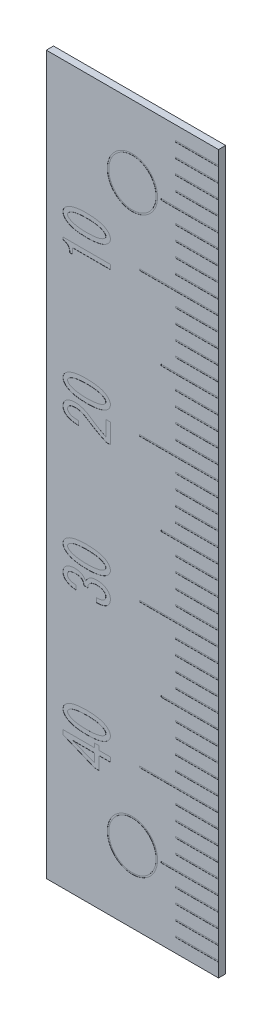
from build123d import *

# Parameters (mm, degrees)
SKETCH1_W      = 12
SKETCH1_H      = 50
EXTRUDE1_DEPTH = 0.5
SKETCH2_R      = 1.75
SKETCH2_R_2    = 1.65
EXTRUDE2_DEPTH = 0.01
EXTRUDE3_DEPTH = 0.01
SKETCH4_W      = 5.5
SKETCH4_H      = 0.1
SKETCH4_W_2    = 3
SKETCH4_W_3    = 4
EXTRUDE4_DEPTH = 0.01


with BuildPart() as part:
    # Sketch1 → Extrude1 (new body)
    with BuildSketch(Plane.XY):
        with Locations((6, 25)):
            Rectangle(SKETCH1_W, SKETCH1_H)
    extrude(amount=EXTRUDE1_DEPTH)

    # Sketch2 → Extrude2 (cut)
    # profile 1 of 2: a face of its own
    with BuildSketch(Plane.XY.offset(0.5)):
        with Locations((6, 5)):
            Circle(SKETCH2_R)
        with Locations((6, 5)):
            Circle(SKETCH2_R_2, mode=Mode.SUBTRACT)
    # profile 2 of 2: a face of its own
    with BuildSketch(Plane.XY.offset(0.5)):
        with Locations((6, 45)):
            Circle(SKETCH2_R)
        with Locations((6, 45)):
            Circle(SKETCH2_R_2, mode=Mode.SUBTRACT)
    extrude(amount=-EXTRUDE2_DEPTH, mode=Mode.SUBTRACT)

    # Sketch3 → Extrude3 (cut)
    # profile 1 of 8: a face of its own
    with BuildSketch(Plane.XY.offset(0.5)):
        with BuildLine():
            Line((4.464202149, 38.983541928), (3.143449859, 38.983541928))
            Line((3.143449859, 38.983541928), (1.834630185, 38.983541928))
            Line((1.834630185, 38.983541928), (1.834630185, 38.58788147))
            Line((1.834630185, 38.58788147), (1.634287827, 38.58788147))
            add(Edge.make_bspline(
                [(1.634287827, 38.58788147), (1.633949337, 38.607154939), (1.633292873, 38.644533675), (1.627537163, 38.699138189), (1.617992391, 38.750485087), (1.605914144, 38.79930573), (1.588535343, 38.844454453), (1.568559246, 38.887235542), (1.544100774, 38.926478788), (1.516032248, 38.962796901), (1.484633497, 38.996211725), (1.449221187, 39.026469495), (1.410057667, 39.053561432), (1.367120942, 39.077453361), (1.320438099, 39.09818504), (1.270182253, 39.115604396), (1.216225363, 39.130205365), (1.17880858, 39.137442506), (1.159495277, 39.141178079)],
                knots=[0, 0, 0, 0, 1.144858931, 2.220325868, 3.257124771, 4.246590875, 5.202985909, 6.126465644, 7.048017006, 7.94360395, 8.849836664, 9.767181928, 10.705616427, 11.674465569, 12.68221077, 13.736395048, 14.831602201, 16, 16, 16, 16], degree=3))
            Line((1.159495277, 39.141178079), (1.159495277, 39.303210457))
            Line((1.159495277, 39.303210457), (4.464202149, 39.303210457))
            Line((4.464202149, 39.303210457), (4.464202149, 38.983541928))
        make_face()
    # profile 2 of 8: a face of its own
    with BuildSketch(Plane.XY.offset(0.5)):
        with BuildLine():
            add(Edge.make_bspline(
                [(2.804312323, 40.08636695), (2.763487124, 40.086598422), (2.683284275, 40.087053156), (2.565184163, 40.090916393), (2.451677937, 40.097059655), (2.342790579, 40.105920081), (2.238418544, 40.116877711), (2.138826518, 40.131643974), (2.043659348, 40.147711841), (1.953367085, 40.166540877), (1.867534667, 40.187646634), (1.786660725, 40.212475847), (1.709981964, 40.238496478), (1.63792646, 40.267351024), (1.571052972, 40.299483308), (1.508231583, 40.333293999), (1.450513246, 40.370357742), (1.414537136, 40.397244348), (1.396891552, 40.410431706)],
                knots=[0, 0, 0, 0, 1.334199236, 2.621091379, 3.861325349, 5.048806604, 6.191184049, 7.29033474, 8.338632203, 9.344988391, 10.304094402, 11.226124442, 12.10888774, 12.949942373, 13.760906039, 14.53244093, 15.280190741, 16, 16, 16, 16], degree=3))
            add(Edge.make_bspline(
                [(1.396891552, 40.410431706), (1.377886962, 40.425936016), (1.341081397, 40.455962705), (1.293642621, 40.506288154), (1.25209867, 40.556343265), (1.218531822, 40.608467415), (1.191781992, 40.661574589), (1.173561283, 40.716630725), (1.161657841, 40.77250316), (1.160214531, 40.810429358), (1.159495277, 40.829329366)],
                knots=[0, 0, 0, 0, 1.179273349, 2.283859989, 3.322502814, 4.306324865, 5.261663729, 6.17616916, 7.091118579, 8, 8, 8, 8], degree=3))
            add(Edge.make_bspline(
                [(1.159495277, 40.829329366), (1.160212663, 40.848230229), (1.161652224, 40.886158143), (1.17358392, 40.942017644), (1.191636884, 40.996945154), (1.218688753, 41.049705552), (1.252296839, 41.101723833), (1.293217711, 41.152330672), (1.341340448, 41.202029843), (1.377935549, 41.232049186), (1.396891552, 41.247598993)],
                knots=[0, 0, 0, 0, 0.909839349, 1.825753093, 2.741222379, 3.688535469, 4.673394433, 5.720979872, 6.819483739, 8, 8, 8, 8], degree=3))
            add(Edge.make_bspline(
                [(1.396891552, 41.247598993), (1.414537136, 41.260786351), (1.450513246, 41.287672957), (1.508231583, 41.3247367), (1.571052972, 41.358547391), (1.63792646, 41.390679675), (1.709981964, 41.419534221), (1.786660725, 41.445554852), (1.867534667, 41.470384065), (1.953367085, 41.491489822), (2.043659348, 41.510318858), (2.138826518, 41.526386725), (2.238418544, 41.541152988), (2.342790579, 41.552110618), (2.451677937, 41.560971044), (2.565184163, 41.567114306), (2.683284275, 41.570977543), (2.763487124, 41.571432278), (2.804312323, 41.571663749)],
                knots=[0, 0, 0, 0, 0.719809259, 1.46755907, 2.239093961, 3.050057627, 3.89111226, 4.773875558, 5.695905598, 6.655011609, 7.661367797, 8.70966526, 9.808815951, 10.951193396, 12.138674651, 13.378908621, 14.665800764, 16, 16, 16, 16], degree=3))
            add(Edge.make_bspline(
                [(2.804312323, 41.571663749), (2.845974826, 41.571432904), (2.927642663, 41.570980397), (3.047627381, 41.567132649), (3.162805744, 41.560946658), (3.273365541, 41.552091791), (3.379218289, 41.541255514), (3.480042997, 41.52631378), (3.576267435, 41.510328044), (3.667806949, 41.49146689), (3.75471717, 41.470480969), (3.836402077, 41.445542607), (3.913707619, 41.419531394), (3.986394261, 41.390685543), (4.053875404, 41.358519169), (4.117234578, 41.324907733), (4.175058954, 41.28765614), (4.211041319, 41.260780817), (4.228689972, 41.247598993)],
                knots=[0, 0, 0, 0, 1.346341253, 2.639130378, 3.8790076, 5.073442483, 6.223226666, 7.316783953, 8.366697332, 9.375051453, 10.336565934, 11.254764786, 12.134057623, 12.971986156, 13.779994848, 14.548849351, 15.288238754, 16, 16, 16, 16], degree=3))
            add(Edge.make_bspline(
                [(4.228689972, 41.247598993), (4.247351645, 41.231964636), (4.283604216, 41.201592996), (4.332476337, 41.152791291), (4.372490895, 41.101447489), (4.406527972, 41.049937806), (4.432289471, 40.996615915), (4.451811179, 40.942259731), (4.462410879, 40.886054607), (4.464024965, 40.848209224), (4.464830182, 40.829329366)],
                knots=[0, 0, 0, 0, 1.1743338, 2.28128622, 3.323893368, 4.309986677, 5.254013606, 6.173907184, 7.08902033, 8, 8, 8, 8], degree=3))
            add(Edge.make_bspline(
                [(4.464830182, 40.829329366), (4.464023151, 40.81045032), (4.462405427, 40.772606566), (4.45183315, 40.716389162), (4.432141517, 40.661902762), (4.406685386, 40.608236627), (4.372691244, 40.556620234), (4.332051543, 40.505827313), (4.283860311, 40.456400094), (4.247399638, 40.426020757), (4.228689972, 40.410431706)],
                knots=[0, 0, 0, 0, 0.910025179, 1.824179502, 2.743109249, 3.69522398, 4.680284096, 5.713901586, 6.826896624, 8, 8, 8, 8], degree=3))
            add(Edge.make_bspline(
                [(4.228689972, 40.410431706), (4.211041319, 40.397249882), (4.175058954, 40.370374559), (4.117234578, 40.333122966), (4.053875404, 40.29951153), (3.986394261, 40.267345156), (3.913707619, 40.238499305), (3.836402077, 40.212488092), (3.75471717, 40.18754973), (3.667806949, 40.166563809), (3.576267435, 40.147702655), (3.480042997, 40.131716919), (3.379218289, 40.116775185), (3.273365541, 40.105938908), (3.162805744, 40.097084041), (3.047627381, 40.09089805), (2.927642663, 40.087050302), (2.845974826, 40.086597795), (2.804312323, 40.08636695)],
                knots=[0, 0, 0, 0, 0.711761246, 1.451150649, 2.220005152, 3.028013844, 3.865942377, 4.745235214, 5.663434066, 6.624948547, 7.633302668, 8.683216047, 9.776773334, 10.926557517, 12.1209924, 13.360869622, 14.653658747, 16, 16, 16, 16], degree=3))
        make_face()
        with BuildLine():
            add(Edge.make_bspline(
                [(2.804312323, 41.261415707), (2.767676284, 41.261069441), (2.695861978, 41.260390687), (2.590316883, 41.258165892), (2.489150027, 41.253278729), (2.392481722, 41.245290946), (2.30022693, 41.237179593), (2.212814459, 41.225295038), (2.129718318, 41.213328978), (2.051258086, 41.197943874), (1.97692929, 41.181420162), (1.907398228, 41.16150603), (1.841873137, 41.141413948), (1.781453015, 41.117852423), (1.725379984, 41.092883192), (1.673815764, 41.065786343), (1.626168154, 41.037204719), (1.597468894, 41.015283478), (1.583417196, 41.004550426)],
                knots=[0, 0, 0, 0, 1.387476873, 2.71974516, 3.997715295, 5.222316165, 6.392993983, 7.5041764, 8.562605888, 9.571696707, 10.531368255, 11.445041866, 12.310057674, 13.125709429, 13.899281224, 14.633331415, 15.330853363, 16, 16, 16, 16], degree=3))
            add(Edge.make_bspline(
                [(1.583417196, 41.004550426), (1.567942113, 40.991309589), (1.538992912, 40.966539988), (1.506840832, 40.922559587), (1.485224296, 40.87705391), (1.482844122, 40.845041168), (1.481675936, 40.829329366)],
                knots=[0, 0, 0, 0, 1.162721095, 2.175099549, 3.10434177, 4, 4, 4, 4], degree=3))
            add(Edge.make_bspline(
                [(1.481675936, 40.829329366), (1.482836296, 40.813611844), (1.485200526, 40.781587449), (1.507018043, 40.736019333), (1.538753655, 40.691521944), (1.567903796, 40.666693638), (1.583417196, 40.653480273)],
                knots=[0, 0, 0, 0, 0.893494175, 1.820491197, 2.840088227, 4, 4, 4, 4], degree=3))
            add(Edge.make_bspline(
                [(1.583417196, 40.653480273), (1.598156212, 40.643035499), (1.628454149, 40.621564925), (1.677291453, 40.592299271), (1.730299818, 40.565060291), (1.787887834, 40.540907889), (1.849363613, 40.517529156), (1.915145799, 40.496237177), (1.985227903, 40.477516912), (2.059390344, 40.460570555), (2.137959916, 40.445608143), (2.220652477, 40.432335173), (2.307623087, 40.421817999), (2.398748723, 40.413272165), (2.494176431, 40.405404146), (2.593874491, 40.400498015), (2.697746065, 40.398267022), (2.768304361, 40.397589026), (2.804312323, 40.397243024)],
                knots=[0, 0, 0, 0, 0.684573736, 1.407229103, 2.156074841, 2.941731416, 3.772993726, 4.648817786, 5.561264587, 6.521855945, 7.531913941, 8.592575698, 9.69595549, 10.851956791, 12.06190895, 13.325252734, 14.634998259, 16, 16, 16, 16], degree=3))
            add(Edge.make_bspline(
                [(2.804312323, 40.397243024), (2.841785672, 40.397588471), (2.915065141, 40.398263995), (3.022703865, 40.400490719), (3.125541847, 40.405385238), (3.223691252, 40.413273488), (3.317323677, 40.421841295), (3.406404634, 40.432229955), (3.490753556, 40.445635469), (3.570391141, 40.460491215), (3.645369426, 40.477539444), (3.715901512, 40.496147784), (3.781702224, 40.517419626), (3.842729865, 40.540898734), (3.899661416, 40.565104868), (3.951853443, 40.591966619), (3.99904188, 40.621590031), (4.028053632, 40.643045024), (4.042164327, 40.653480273)],
                knots=[0, 0, 0, 0, 1.401046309, 2.739758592, 4.0248449, 5.249399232, 6.420696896, 7.540008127, 8.601571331, 9.613140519, 10.568176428, 11.475655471, 12.339456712, 13.151990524, 13.919674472, 14.651282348, 15.344012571, 16, 16, 16, 16], degree=3))
            add(Edge.make_bspline(
                [(4.042164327, 40.653480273), (4.057596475, 40.666746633), (4.086687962, 40.691755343), (4.119429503, 40.735654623), (4.140196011, 40.781762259), (4.142682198, 40.813642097), (4.143905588, 40.829329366)],
                knots=[0, 0, 0, 0, 1.159232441, 2.18529495, 3.107029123, 4, 4, 4, 4], degree=3))
            add(Edge.make_bspline(
                [(4.143905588, 40.829329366), (4.142674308, 40.845010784), (4.140172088, 40.876878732), (4.119603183, 40.922925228), (4.086449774, 40.966304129), (4.057558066, 40.991255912), (4.042164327, 41.004550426)],
                knots=[0, 0, 0, 0, 0.89511734, 1.819067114, 2.837981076, 4, 4, 4, 4], degree=3))
            add(Edge.make_bspline(
                [(4.042164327, 41.004550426), (4.028109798, 41.015278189), (3.999404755, 41.037188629), (3.95164342, 41.065951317), (3.899548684, 41.092855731), (3.842868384, 41.117856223), (3.781814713, 41.14140776), (3.715668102, 41.161504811), (3.64550559, 41.181409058), (3.570358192, 41.198018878), (3.490830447, 41.213306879), (3.406283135, 41.225349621), (3.317389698, 41.237124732), (3.22367965, 41.245296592), (3.125545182, 41.253298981), (3.022702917, 41.258160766), (2.915065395, 41.26039668), (2.841785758, 41.261070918), (2.804312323, 41.261415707)],
                knots=[0, 0, 0, 0, 0.660466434, 1.348940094, 2.080407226, 2.851088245, 3.663465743, 4.524722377, 5.434082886, 6.388935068, 7.400309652, 8.46048529, 9.580538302, 10.751610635, 11.975929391, 13.260768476, 14.599223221, 16, 16, 16, 16], degree=3))
        make_face(mode=Mode.SUBTRACT)
    # profile 3 of 8: a face of its own
    with BuildSketch(Plane.XY.offset(0.5)):
        with BuildLine():
            Line((4.143905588, 29.789307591), (4.464830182, 29.789307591))
            Line((4.464830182, 29.789307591), (4.464830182, 28.412032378))
            Line((4.464830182, 28.412032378), (4.194776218, 28.412032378))
            add(Edge.make_bspline(
                [(4.194776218, 28.412032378), (4.134104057, 28.438239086), (4.012820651, 28.490626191), (3.833941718, 28.576059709), (3.65666089, 28.664824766), (3.482086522, 28.759401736), (3.309323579, 28.858008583), (3.138392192, 28.960822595), (2.969988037, 29.068963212), (2.859615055, 29.144268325), (2.804312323, 29.18200019)],
                knots=[0, 0, 0, 0, 0.99614483, 1.991289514, 2.987624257, 3.984438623, 4.983697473, 5.985971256, 6.990864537, 8, 8, 8, 8], degree=3))
            add(Edge.make_bspline(
                [(2.804312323, 29.18200019), (2.773407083, 29.202561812), (2.712458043, 29.24311193), (2.617211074, 29.295150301), (2.521104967, 29.339278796), (2.423672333, 29.375332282), (2.325440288, 29.4035815), (2.22593849, 29.42388529), (2.125513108, 29.436178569), (2.058034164, 29.437551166), (2.024295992, 29.438237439)],
                knots=[0, 0, 0, 0, 1.067918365, 2.106070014, 3.119789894, 4.109153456, 5.093164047, 6.058534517, 7.029304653, 8, 8, 8, 8], degree=3))
            add(Edge.make_bspline(
                [(2.024295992, 29.438237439), (2.001046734, 29.437894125), (1.955732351, 29.437224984), (1.889860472, 29.431518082), (1.828132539, 29.422267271), (1.770797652, 29.409104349), (1.71743613, 29.392320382), (1.668710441, 29.370724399), (1.623431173, 29.346637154), (1.596599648, 29.326782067), (1.583417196, 29.317027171)],
                knots=[0, 0, 0, 0, 1.197973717, 2.334932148, 3.404529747, 4.412096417, 5.3640046, 6.281988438, 7.155932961, 8, 8, 8, 8], degree=3))
            add(Edge.make_bspline(
                [(1.583417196, 29.317027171), (1.567746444, 29.303076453), (1.537248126, 29.275925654), (1.505254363, 29.223199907), (1.484772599, 29.164442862), (1.482726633, 29.122515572), (1.481675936, 29.100984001)],
                knots=[0, 0, 0, 0, 1.01321699, 1.971916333, 2.958486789, 4, 4, 4, 4], degree=3))
            add(Edge.make_bspline(
                [(1.481675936, 29.100984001), (1.483585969, 29.082717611), (1.487575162, 29.044567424), (1.51537348, 28.988943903), (1.559276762, 28.934674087), (1.597036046, 28.902326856), (1.61733095, 28.88494083)],
                knots=[0, 0, 0, 0, 0.831770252, 1.737190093, 2.783782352, 4, 4, 4, 4], degree=3))
            add(Edge.make_bspline(
                [(1.61733095, 28.88494083), (1.63152823, 28.875101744), (1.661915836, 28.854042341), (1.715884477, 28.829594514), (1.77953563, 28.808918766), (1.853234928, 28.792609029), (1.936819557, 28.778578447), (2.030630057, 28.769762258), (2.13433812, 28.764032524), (2.206835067, 28.763421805), (2.24473539, 28.76310253)],
                knots=[0, 0, 0, 0, 0.638255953, 1.36611168, 2.182006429, 3.11234378, 4.156826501, 5.317109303, 6.597424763, 8, 8, 8, 8], degree=3))
            Line((2.24473539, 28.76310253), (2.24473539, 28.466043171))
            add(Edge.make_bspline(
                [(2.24473539, 28.466043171), (2.195515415, 28.46790543), (2.100702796, 28.471492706), (1.963728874, 28.483794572), (1.837426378, 28.503038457), (1.721668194, 28.528812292), (1.616016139, 28.559516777), (1.521404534, 28.598268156), (1.436291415, 28.64179784), (1.386844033, 28.67828985), (1.362977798, 28.695903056)],
                knots=[0, 0, 0, 0, 1.276449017, 2.458828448, 3.562299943, 4.585123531, 5.530965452, 6.409552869, 7.23235602, 8, 8, 8, 8], degree=3))
            add(Edge.make_bspline(
                [(1.362977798, 28.695903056), (1.346729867, 28.709564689), (1.314699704, 28.736496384), (1.273183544, 28.782576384), (1.238532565, 28.832204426), (1.208926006, 28.884437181), (1.187412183, 28.940944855), (1.17065538, 29.000105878), (1.161233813, 29.063001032), (1.160084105, 29.105978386), (1.159495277, 29.127989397)],
                knots=[0, 0, 0, 0, 1.027969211, 2.026474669, 2.994832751, 3.957646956, 4.927969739, 5.917517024, 6.933448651, 8, 8, 8, 8], degree=3))
            add(Edge.make_bspline(
                [(1.159495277, 29.127989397), (1.159956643, 29.148979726), (1.160867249, 29.190408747), (1.172379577, 29.250967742), (1.188861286, 29.309450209), (1.21397118, 29.364787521), (1.24481477, 29.418042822), (1.282906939, 29.468678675), (1.328294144, 29.516390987), (1.362484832, 29.545314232), (1.379934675, 29.560075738)],
                knots=[0, 0, 0, 0, 1.000230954, 1.974175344, 2.932001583, 3.893571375, 4.865053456, 5.864036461, 6.909871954, 8, 8, 8, 8], degree=3))
            add(Edge.make_bspline(
                [(1.379934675, 29.560075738), (1.400321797, 29.575446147), (1.441611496, 29.606575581), (1.510569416, 29.644342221), (1.584899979, 29.676515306), (1.664800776, 29.703727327), (1.75083857, 29.724143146), (1.84261768, 29.738396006), (1.93996472, 29.747294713), (2.006900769, 29.748496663), (2.041252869, 29.749113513)],
                knots=[0, 0, 0, 0, 0.873404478, 1.768891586, 2.683909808, 3.645167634, 4.655436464, 5.707963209, 6.823708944, 8, 8, 8, 8], degree=3))
            add(Edge.make_bspline(
                [(2.041252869, 29.749113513), (2.0825466, 29.747997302), (2.165684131, 29.745750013), (2.2908176, 29.728176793), (2.416613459, 29.69873904), (2.543909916, 29.659401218), (2.671696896, 29.607206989), (2.800597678, 29.544064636), (2.930892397, 29.470149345), (3.015481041, 29.41326659), (3.058665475, 29.384226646)],
                knots=[0, 0, 0, 0, 0.902713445, 1.817451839, 2.756860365, 3.725448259, 4.727634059, 5.771721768, 6.862413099, 8, 8, 8, 8], degree=3))
            add(Edge.make_bspline(
                [(3.058665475, 29.384226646), (3.150692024, 29.32107194), (3.331341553, 29.197098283), (3.605692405, 29.027797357), (3.87414261, 28.87223849), (4.055117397, 28.780905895), (4.143905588, 28.736097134)],
                knots=[0, 0, 0, 0, 1.058433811, 2.077721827, 3.056909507, 4, 4, 4, 4], degree=3))
            Line((4.143905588, 28.736097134), (4.143905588, 29.789307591))
        make_face()
    # profile 4 of 8: a face of its own
    with BuildSketch(Plane.XY.offset(0.5)):
        with BuildLine():
            add(Edge.make_bspline(
                [(2.804312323, 30.08636695), (2.763487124, 30.086598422), (2.683284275, 30.087053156), (2.565184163, 30.090916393), (2.451677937, 30.097059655), (2.342790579, 30.105920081), (2.238418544, 30.116877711), (2.138826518, 30.131643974), (2.043659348, 30.147711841), (1.953367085, 30.166540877), (1.867534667, 30.187646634), (1.786660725, 30.212475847), (1.709981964, 30.238496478), (1.63792646, 30.267351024), (1.571052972, 30.299483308), (1.508231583, 30.333293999), (1.450513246, 30.370357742), (1.414537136, 30.397244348), (1.396891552, 30.410431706)],
                knots=[0, 0, 0, 0, 1.334199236, 2.621091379, 3.861325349, 5.048806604, 6.191184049, 7.29033474, 8.338632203, 9.344988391, 10.304094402, 11.226124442, 12.10888774, 12.949942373, 13.760906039, 14.53244093, 15.280190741, 16, 16, 16, 16], degree=3))
            add(Edge.make_bspline(
                [(1.396891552, 30.410431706), (1.377886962, 30.425936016), (1.341081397, 30.455962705), (1.293642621, 30.506288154), (1.25209867, 30.556343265), (1.218531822, 30.608467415), (1.191781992, 30.661574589), (1.173561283, 30.716630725), (1.161657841, 30.77250316), (1.160214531, 30.810429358), (1.159495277, 30.829329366)],
                knots=[0, 0, 0, 0, 1.179273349, 2.283859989, 3.322502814, 4.306324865, 5.261663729, 6.17616916, 7.091118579, 8, 8, 8, 8], degree=3))
            add(Edge.make_bspline(
                [(1.159495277, 30.829329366), (1.160212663, 30.848230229), (1.161652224, 30.886158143), (1.17358392, 30.942017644), (1.191636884, 30.996945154), (1.218688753, 31.049705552), (1.252296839, 31.101723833), (1.293217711, 31.152330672), (1.341340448, 31.202029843), (1.377935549, 31.232049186), (1.396891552, 31.247598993)],
                knots=[0, 0, 0, 0, 0.909839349, 1.825753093, 2.741222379, 3.688535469, 4.673394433, 5.720979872, 6.819483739, 8, 8, 8, 8], degree=3))
            add(Edge.make_bspline(
                [(1.396891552, 31.247598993), (1.414537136, 31.260786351), (1.450513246, 31.287672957), (1.508231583, 31.3247367), (1.571052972, 31.358547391), (1.63792646, 31.390679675), (1.709981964, 31.419534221), (1.786660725, 31.445554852), (1.867534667, 31.470384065), (1.953367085, 31.491489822), (2.043659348, 31.510318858), (2.138826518, 31.526386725), (2.238418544, 31.541152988), (2.342790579, 31.552110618), (2.451677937, 31.560971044), (2.565184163, 31.567114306), (2.683284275, 31.570977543), (2.763487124, 31.571432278), (2.804312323, 31.571663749)],
                knots=[0, 0, 0, 0, 0.719809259, 1.46755907, 2.239093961, 3.050057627, 3.89111226, 4.773875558, 5.695905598, 6.655011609, 7.661367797, 8.70966526, 9.808815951, 10.951193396, 12.138674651, 13.378908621, 14.665800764, 16, 16, 16, 16], degree=3))
            add(Edge.make_bspline(
                [(2.804312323, 31.571663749), (2.845974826, 31.571432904), (2.927642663, 31.570980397), (3.047627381, 31.567132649), (3.162805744, 31.560946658), (3.273365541, 31.552091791), (3.379218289, 31.541255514), (3.480042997, 31.52631378), (3.576267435, 31.510328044), (3.667806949, 31.49146689), (3.75471717, 31.470480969), (3.836402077, 31.445542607), (3.913707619, 31.419531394), (3.986394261, 31.390685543), (4.053875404, 31.358519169), (4.117234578, 31.324907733), (4.175058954, 31.28765614), (4.211041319, 31.260780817), (4.228689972, 31.247598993)],
                knots=[0, 0, 0, 0, 1.346341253, 2.639130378, 3.8790076, 5.073442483, 6.223226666, 7.316783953, 8.366697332, 9.375051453, 10.336565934, 11.254764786, 12.134057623, 12.971986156, 13.779994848, 14.548849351, 15.288238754, 16, 16, 16, 16], degree=3))
            add(Edge.make_bspline(
                [(4.228689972, 31.247598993), (4.247351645, 31.231964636), (4.283604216, 31.201592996), (4.332476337, 31.152791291), (4.372490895, 31.101447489), (4.406527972, 31.049937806), (4.432289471, 30.996615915), (4.451811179, 30.942259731), (4.462410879, 30.886054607), (4.464024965, 30.848209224), (4.464830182, 30.829329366)],
                knots=[0, 0, 0, 0, 1.1743338, 2.28128622, 3.323893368, 4.309986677, 5.254013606, 6.173907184, 7.08902033, 8, 8, 8, 8], degree=3))
            add(Edge.make_bspline(
                [(4.464830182, 30.829329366), (4.464023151, 30.81045032), (4.462405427, 30.772606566), (4.45183315, 30.716389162), (4.432141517, 30.661902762), (4.406685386, 30.608236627), (4.372691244, 30.556620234), (4.332051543, 30.505827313), (4.283860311, 30.456400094), (4.247399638, 30.426020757), (4.228689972, 30.410431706)],
                knots=[0, 0, 0, 0, 0.910025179, 1.824179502, 2.743109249, 3.69522398, 4.680284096, 5.713901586, 6.826896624, 8, 8, 8, 8], degree=3))
            add(Edge.make_bspline(
                [(4.228689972, 30.410431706), (4.211041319, 30.397249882), (4.175058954, 30.370374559), (4.117234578, 30.333122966), (4.053875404, 30.29951153), (3.986394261, 30.267345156), (3.913707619, 30.238499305), (3.836402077, 30.212488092), (3.75471717, 30.18754973), (3.667806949, 30.166563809), (3.576267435, 30.147702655), (3.480042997, 30.131716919), (3.379218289, 30.116775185), (3.273365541, 30.105938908), (3.162805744, 30.097084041), (3.047627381, 30.09089805), (2.927642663, 30.087050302), (2.845974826, 30.086597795), (2.804312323, 30.08636695)],
                knots=[0, 0, 0, 0, 0.711761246, 1.451150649, 2.220005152, 3.028013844, 3.865942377, 4.745235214, 5.663434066, 6.624948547, 7.633302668, 8.683216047, 9.776773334, 10.926557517, 12.1209924, 13.360869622, 14.653658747, 16, 16, 16, 16], degree=3))
        make_face()
        with BuildLine():
            add(Edge.make_bspline(
                [(2.804312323, 31.261415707), (2.767676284, 31.261069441), (2.695861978, 31.260390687), (2.590316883, 31.258165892), (2.489150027, 31.253278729), (2.392481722, 31.245290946), (2.30022693, 31.237179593), (2.212814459, 31.225295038), (2.129718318, 31.213328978), (2.051258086, 31.197943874), (1.97692929, 31.181420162), (1.907398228, 31.16150603), (1.841873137, 31.141413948), (1.781453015, 31.117852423), (1.725379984, 31.092883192), (1.673815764, 31.065786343), (1.626168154, 31.037204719), (1.597468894, 31.015283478), (1.583417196, 31.004550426)],
                knots=[0, 0, 0, 0, 1.387476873, 2.71974516, 3.997715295, 5.222316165, 6.392993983, 7.5041764, 8.562605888, 9.571696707, 10.531368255, 11.445041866, 12.310057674, 13.125709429, 13.899281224, 14.633331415, 15.330853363, 16, 16, 16, 16], degree=3))
            add(Edge.make_bspline(
                [(1.583417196, 31.004550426), (1.567942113, 30.991309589), (1.538992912, 30.966539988), (1.506840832, 30.922559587), (1.485224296, 30.87705391), (1.482844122, 30.845041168), (1.481675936, 30.829329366)],
                knots=[0, 0, 0, 0, 1.162721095, 2.175099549, 3.10434177, 4, 4, 4, 4], degree=3))
            add(Edge.make_bspline(
                [(1.481675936, 30.829329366), (1.482836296, 30.813611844), (1.485200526, 30.781587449), (1.507018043, 30.736019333), (1.538753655, 30.691521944), (1.567903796, 30.666693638), (1.583417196, 30.653480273)],
                knots=[0, 0, 0, 0, 0.893494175, 1.820491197, 2.840088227, 4, 4, 4, 4], degree=3))
            add(Edge.make_bspline(
                [(1.583417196, 30.653480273), (1.598156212, 30.643035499), (1.628454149, 30.621564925), (1.677291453, 30.592299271), (1.730299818, 30.565060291), (1.787887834, 30.540907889), (1.849363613, 30.517529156), (1.915145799, 30.496237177), (1.985227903, 30.477516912), (2.059390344, 30.460570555), (2.137959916, 30.445608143), (2.220652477, 30.432335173), (2.307623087, 30.421817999), (2.398748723, 30.413272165), (2.494176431, 30.405404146), (2.593874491, 30.400498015), (2.697746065, 30.398267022), (2.768304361, 30.397589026), (2.804312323, 30.397243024)],
                knots=[0, 0, 0, 0, 0.684573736, 1.407229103, 2.156074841, 2.941731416, 3.772993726, 4.648817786, 5.561264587, 6.521855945, 7.531913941, 8.592575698, 9.69595549, 10.851956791, 12.06190895, 13.325252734, 14.634998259, 16, 16, 16, 16], degree=3))
            add(Edge.make_bspline(
                [(2.804312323, 30.397243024), (2.841785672, 30.397588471), (2.915065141, 30.398263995), (3.022703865, 30.400490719), (3.125541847, 30.405385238), (3.223691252, 30.413273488), (3.317323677, 30.421841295), (3.406404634, 30.432229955), (3.490753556, 30.445635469), (3.570391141, 30.460491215), (3.645369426, 30.477539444), (3.715901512, 30.496147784), (3.781702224, 30.517419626), (3.842729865, 30.540898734), (3.899661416, 30.565104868), (3.951853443, 30.591966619), (3.99904188, 30.621590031), (4.028053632, 30.643045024), (4.042164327, 30.653480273)],
                knots=[0, 0, 0, 0, 1.401046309, 2.739758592, 4.0248449, 5.249399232, 6.420696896, 7.540008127, 8.601571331, 9.613140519, 10.568176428, 11.475655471, 12.339456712, 13.151990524, 13.919674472, 14.651282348, 15.344012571, 16, 16, 16, 16], degree=3))
            add(Edge.make_bspline(
                [(4.042164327, 30.653480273), (4.057596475, 30.666746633), (4.086687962, 30.691755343), (4.119429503, 30.735654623), (4.140196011, 30.781762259), (4.142682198, 30.813642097), (4.143905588, 30.829329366)],
                knots=[0, 0, 0, 0, 1.159232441, 2.18529495, 3.107029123, 4, 4, 4, 4], degree=3))
            add(Edge.make_bspline(
                [(4.143905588, 30.829329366), (4.142674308, 30.845010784), (4.140172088, 30.876878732), (4.119603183, 30.922925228), (4.086449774, 30.966304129), (4.057558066, 30.991255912), (4.042164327, 31.004550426)],
                knots=[0, 0, 0, 0, 0.89511734, 1.819067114, 2.837981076, 4, 4, 4, 4], degree=3))
            add(Edge.make_bspline(
                [(4.042164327, 31.004550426), (4.028109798, 31.015278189), (3.999404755, 31.037188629), (3.95164342, 31.065951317), (3.899548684, 31.092855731), (3.842868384, 31.117856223), (3.781814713, 31.14140776), (3.715668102, 31.161504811), (3.64550559, 31.181409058), (3.570358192, 31.198018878), (3.490830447, 31.213306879), (3.406283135, 31.225349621), (3.317389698, 31.237124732), (3.22367965, 31.245296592), (3.125545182, 31.253298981), (3.022702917, 31.258160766), (2.915065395, 31.26039668), (2.841785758, 31.261070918), (2.804312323, 31.261415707)],
                knots=[0, 0, 0, 0, 0.660466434, 1.348940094, 2.080407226, 2.851088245, 3.663465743, 4.524722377, 5.434082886, 6.388935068, 7.400309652, 8.46048529, 9.580538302, 10.751610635, 11.975929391, 13.260768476, 14.599223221, 16, 16, 16, 16], degree=3))
        make_face(mode=Mode.SUBTRACT)
    # profile 5 of 8: a face of its own
    with BuildSketch(Plane.XY.offset(0.5)):
        with BuildLine():
            add(Edge.make_bspline(
                [(3.482587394, 18.709091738), (3.512525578, 18.708287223), (3.570543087, 18.706728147), (3.654420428, 18.710760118), (3.732130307, 18.718455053), (3.803298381, 18.73168567), (3.868273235, 18.749141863), (3.927053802, 18.770782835), (3.979378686, 18.79791141), (4.010164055, 18.820091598), (4.025207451, 18.830930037)],
                knots=[0, 0, 0, 0, 1.267087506, 2.455501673, 3.55133733, 4.569646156, 5.515332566, 6.395721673, 7.21606285, 8, 8, 8, 8], degree=3))
            add(Edge.make_bspline(
                [(4.025207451, 18.830930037), (4.043506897, 18.847280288), (4.079345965, 18.8793019), (4.117183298, 18.941459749), (4.139871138, 19.011713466), (4.142530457, 19.061449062), (4.143905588, 19.087167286)],
                knots=[0, 0, 0, 0, 1.002413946, 1.963205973, 2.946775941, 4, 4, 4, 4], degree=3))
            add(Edge.make_bspline(
                [(4.143905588, 19.087167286), (4.14205895, 19.10966892), (4.138250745, 19.15607263), (4.10631016, 19.222801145), (4.057507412, 19.287350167), (4.014319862, 19.324320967), (3.991293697, 19.344032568)],
                knots=[0, 0, 0, 0, 0.87119639, 1.796613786, 2.82522778, 4, 4, 4, 4], degree=3))
            add(Edge.make_bspline(
                [(3.991293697, 19.344032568), (3.977715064, 19.35383947), (3.949615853, 19.374133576), (3.90102721, 19.398039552), (3.847048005, 19.41973801), (3.786272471, 19.436247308), (3.719328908, 19.449449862), (3.646079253, 19.458528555), (3.566417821, 19.464292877), (3.511278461, 19.464917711), (3.482587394, 19.465242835)],
                knots=[0, 0, 0, 0, 0.754595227, 1.561536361, 2.43511806, 3.377163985, 4.397951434, 5.512234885, 6.705522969, 8, 8, 8, 8], degree=3))
            add(Edge.make_bspline(
                [(3.482587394, 19.465242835), (3.460377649, 19.46473344), (3.416687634, 19.463731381), (3.35267071, 19.456647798), (3.291236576, 19.44559945), (3.232735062, 19.428991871), (3.176430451, 19.40846888), (3.123062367, 19.382368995), (3.071883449, 19.352579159), (3.040443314, 19.328863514), (3.024751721, 19.317027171)],
                knots=[0, 0, 0, 0, 1.086352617, 2.137024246, 3.147391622, 4.136355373, 5.10847195, 6.074961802, 7.039224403, 8, 8, 8, 8], degree=3))
            add(Edge.make_bspline(
                [(3.024751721, 19.317027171), (3.014022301, 19.307663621), (2.992758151, 19.289106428), (2.965670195, 19.256771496), (2.94319759, 19.221167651), (2.926529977, 19.181802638), (2.913593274, 19.139332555), (2.906578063, 19.093273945), (2.903067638, 19.044064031), (2.905038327, 19.010337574), (2.906053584, 18.992962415)],
                knots=[0, 0, 0, 0, 0.947861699, 1.87852391, 2.799832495, 3.743268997, 4.71875736, 5.750864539, 6.841292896, 8, 8, 8, 8], degree=3))
            Line((2.906053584, 18.992962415), (2.617786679, 18.992962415))
            add(Edge.make_bspline(
                [(2.617786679, 18.992962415), (2.615917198, 19.01036469), (2.61227151, 19.044300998), (2.603170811, 19.09366086), (2.589082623, 19.139312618), (2.572365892, 19.182135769), (2.550836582, 19.220887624), (2.526138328, 19.256550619), (2.497813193, 19.288974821), (2.476089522, 19.307646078), (2.465174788, 19.317027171)],
                knots=[0, 0, 0, 0, 1.139052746, 2.221275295, 3.260086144, 4.244297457, 5.207730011, 6.137529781, 7.064229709, 8, 8, 8, 8], degree=3))
            add(Edge.make_bspline(
                [(2.465174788, 19.317027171), (2.453430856, 19.325692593), (2.429384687, 19.343435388), (2.388683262, 19.365118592), (2.344024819, 19.38418922), (2.294826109, 19.398815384), (2.241812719, 19.411043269), (2.184417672, 19.41879032), (2.12278159, 19.423939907), (2.080202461, 19.42467109), (2.058209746, 19.425048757)],
                knots=[0, 0, 0, 0, 0.816014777, 1.670822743, 2.574059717, 3.530392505, 4.539613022, 5.616822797, 6.769055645, 8, 8, 8, 8], degree=3))
            add(Edge.make_bspline(
                [(2.058209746, 19.425048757), (2.030985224, 19.424710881), (1.978357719, 19.424057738), (1.902231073, 19.418395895), (1.831762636, 19.409047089), (1.766898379, 19.396390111), (1.708285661, 19.3784051), (1.654956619, 19.358063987), (1.60766056, 19.33316966), (1.579858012, 19.312952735), (1.56646032, 19.303210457)],
                knots=[0, 0, 0, 0, 1.267211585, 2.44963652, 3.550842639, 4.575246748, 5.5217347, 6.401234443, 7.229575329, 8, 8, 8, 8], degree=3))
            add(Edge.make_bspline(
                [(1.56646032, 19.303210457), (1.550800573, 19.289680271), (1.520516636, 19.263514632), (1.489112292, 19.21338768), (1.467772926, 19.159180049), (1.465751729, 19.120663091), (1.464719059, 19.100984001)],
                knots=[0, 0, 0, 0, 1.053722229, 2.037763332, 2.997453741, 4, 4, 4, 4], degree=3))
            add(Edge.make_bspline(
                [(1.464719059, 19.100984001), (1.465793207, 19.081323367), (1.467906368, 19.0426452), (1.488749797, 18.988170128), (1.520925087, 18.938367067), (1.550860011, 18.911914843), (1.56646032, 18.898129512)],
                knots=[0, 0, 0, 0, 1.000412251, 1.968100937, 2.94109465, 4, 4, 4, 4], degree=3))
            add(Edge.make_bspline(
                [(1.56646032, 18.898129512), (1.581277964, 18.887055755), (1.611428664, 18.864523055), (1.662612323, 18.837488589), (1.718046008, 18.812216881), (1.779698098, 18.793150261), (1.845928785, 18.775455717), (1.917710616, 18.763754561), (1.994531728, 18.75366975), (2.047707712, 18.75119286), (2.075166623, 18.749913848)],
                knots=[0, 0, 0, 0, 0.823448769, 1.675540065, 2.573857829, 3.535986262, 4.547798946, 5.627975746, 6.775138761, 8, 8, 8, 8], degree=3))
            Line((2.075166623, 18.749913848), (2.075166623, 18.452854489))
            add(Edge.make_bspline(
                [(2.075166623, 18.452854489), (2.039320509, 18.454383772), (1.969081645, 18.457380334), (1.86662153, 18.471341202), (1.769148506, 18.489228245), (1.677509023, 18.515831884), (1.590488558, 18.54647123), (1.509243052, 18.585395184), (1.432662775, 18.629471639), (1.386090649, 18.664635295), (1.362977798, 18.682086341)],
                knots=[0, 0, 0, 0, 1.130465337, 2.215096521, 3.257023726, 4.251490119, 5.220175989, 6.161913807, 7.087793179, 8, 8, 8, 8], degree=3))
            add(Edge.make_bspline(
                [(1.362977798, 18.682086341), (1.3467956, 18.695809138), (1.31513049, 18.722661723), (1.272968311, 18.767477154), (1.238724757, 18.816404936), (1.209237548, 18.867139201), (1.18725208, 18.92158891), (1.170766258, 18.978543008), (1.161240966, 19.038909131), (1.160084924, 19.080016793), (1.159495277, 19.100984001)],
                knots=[0, 0, 0, 0, 1.054146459, 2.062739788, 3.04727221, 4.0164563, 4.972878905, 5.957576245, 6.958249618, 8, 8, 8, 8], degree=3))
            add(Edge.make_bspline(
                [(1.159495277, 19.100984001), (1.160084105, 19.122995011), (1.161233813, 19.165972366), (1.17065538, 19.228867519), (1.187412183, 19.288028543), (1.208926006, 19.344536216), (1.238532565, 19.396768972), (1.273183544, 19.446397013), (1.314699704, 19.492477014), (1.346729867, 19.519408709), (1.362977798, 19.533070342)],
                knots=[0, 0, 0, 0, 1.066551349, 2.082482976, 3.072030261, 4.042353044, 5.005167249, 5.973525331, 6.972030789, 8, 8, 8, 8], degree=3))
            add(Edge.make_bspline(
                [(1.362977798, 19.533070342), (1.383180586, 19.548391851), (1.423800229, 19.579197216), (1.49101211, 19.617407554), (1.563031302, 19.649133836), (1.639054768, 19.676462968), (1.720201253, 19.697274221), (1.806188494, 19.711237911), (1.896823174, 19.720285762), (1.958748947, 19.721491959), (1.990382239, 19.722108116)],
                knots=[0, 0, 0, 0, 0.910342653, 1.830331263, 2.769796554, 3.735781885, 4.730142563, 5.775142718, 6.863485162, 8, 8, 8, 8], degree=3))
            add(Edge.make_bspline(
                [(1.990382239, 19.722108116), (2.019286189, 19.72161156), (2.075295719, 19.720649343), (2.156472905, 19.713669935), (2.232474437, 19.70249683), (2.303229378, 19.686672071), (2.368446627, 19.664650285), (2.428974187, 19.640082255), (2.484286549, 19.610093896), (2.516949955, 19.585400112), (2.533002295, 19.57326442)],
                knots=[0, 0, 0, 0, 1.210143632, 2.344993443, 3.40861805, 4.424997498, 5.37575867, 6.287368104, 7.158331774, 8, 8, 8, 8], degree=3))
            add(Edge.make_bspline(
                [(2.533002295, 19.57326442), (2.559175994, 19.551536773), (2.608490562, 19.51059913), (2.671793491, 19.445781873), (2.721317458, 19.38266922), (2.743208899, 19.337936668), (2.753441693, 19.317027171)],
                knots=[0, 0, 0, 0, 1.195517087, 2.252505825, 3.183162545, 4, 4, 4, 4], degree=3))
            add(Edge.make_bspline(
                [(2.753441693, 19.317027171), (2.765088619, 19.34500906), (2.787538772, 19.398945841), (2.831763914, 19.47199791), (2.881380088, 19.535717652), (2.920772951, 19.570253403), (2.939967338, 19.587081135)],
                knots=[0, 0, 0, 0, 1.094399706, 2.109521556, 3.078854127, 4, 4, 4, 4], degree=3))
            add(Edge.make_bspline(
                [(2.939967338, 19.587081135), (2.959994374, 19.60234586), (2.999821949, 19.632702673), (3.064355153, 19.670989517), (3.132227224, 19.703077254), (3.202874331, 19.730156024), (3.276856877, 19.751027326), (3.354027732, 19.765256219), (3.434226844, 19.774233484), (3.488843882, 19.775485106), (3.516501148, 19.776118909)],
                knots=[0, 0, 0, 0, 0.976244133, 1.941447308, 2.904084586, 3.885987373, 4.873249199, 5.881498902, 6.927222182, 8, 8, 8, 8], degree=3))
            add(Edge.make_bspline(
                [(3.516501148, 19.776118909), (3.552324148, 19.77559206), (3.622443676, 19.774560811), (3.725084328, 19.764261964), (3.822576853, 19.747624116), (3.914506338, 19.72361205), (4.001245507, 19.69357359), (4.082537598, 19.656250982), (4.159144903, 19.612707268), (4.205595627, 19.577553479), (4.228689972, 19.560075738)],
                knots=[0, 0, 0, 0, 1.13285732, 2.217441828, 3.259318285, 4.258350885, 5.219645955, 6.158999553, 7.084692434, 8, 8, 8, 8], degree=3))
            add(Edge.make_bspline(
                [(4.228689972, 19.560075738), (4.247408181, 19.544073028), (4.284031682, 19.512762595), (4.332853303, 19.461250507), (4.373280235, 19.40591535), (4.406871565, 19.348128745), (4.432721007, 19.287091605), (4.451971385, 19.223397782), (4.462541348, 19.156184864), (4.464058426, 19.110438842), (4.464830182, 19.087167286)],
                knots=[0, 0, 0, 0, 1.078182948, 2.109541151, 3.099814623, 4.073306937, 5.030426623, 5.996463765, 6.980776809, 8, 8, 8, 8], degree=3))
            add(Edge.make_bspline(
                [(4.464830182, 19.087167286), (4.464367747, 19.062001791), (4.463461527, 19.012685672), (4.452274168, 18.941195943), (4.435512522, 18.873719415), (4.411441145, 18.810497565), (4.38066456, 18.751121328), (4.342591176, 18.696168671), (4.297876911, 18.645289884), (4.263207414, 18.615937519), (4.245646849, 18.601070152)],
                knots=[0, 0, 0, 0, 1.091653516, 2.139282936, 3.133504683, 4.105839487, 5.069340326, 6.029921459, 7.002128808, 8, 8, 8, 8], degree=3))
            add(Edge.make_bspline(
                [(4.245646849, 18.601070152), (4.223356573, 18.584883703), (4.177849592, 18.551838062), (4.101818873, 18.510403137), (4.01783525, 18.476087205), (3.926096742, 18.448030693), (3.826687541, 18.425207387), (3.71890008, 18.410072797), (3.603344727, 18.400491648), (3.523639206, 18.399403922), (3.482587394, 18.398843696)],
                knots=[0, 0, 0, 0, 0.821972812, 1.678108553, 2.577822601, 3.526913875, 4.539938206, 5.620279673, 6.774340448, 8, 8, 8, 8], degree=3))
            Line((3.482587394, 18.398843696), (3.482587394, 18.709091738))
        make_face()
    # profile 6 of 8: a face of its own
    with BuildSketch(Plane.XY.offset(0.5)):
        with BuildLine():
            add(Edge.make_bspline(
                [(2.804312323, 20.08636695), (2.763487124, 20.086598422), (2.683284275, 20.087053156), (2.565184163, 20.090916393), (2.451677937, 20.097059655), (2.342790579, 20.105920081), (2.238418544, 20.116877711), (2.138826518, 20.131643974), (2.043659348, 20.147711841), (1.953367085, 20.166540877), (1.867534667, 20.187646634), (1.786660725, 20.212475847), (1.709981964, 20.238496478), (1.63792646, 20.267351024), (1.571052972, 20.299483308), (1.508231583, 20.333293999), (1.450513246, 20.370357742), (1.414537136, 20.397244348), (1.396891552, 20.410431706)],
                knots=[0, 0, 0, 0, 1.334199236, 2.621091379, 3.861325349, 5.048806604, 6.191184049, 7.29033474, 8.338632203, 9.344988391, 10.304094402, 11.226124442, 12.10888774, 12.949942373, 13.760906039, 14.53244093, 15.280190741, 16, 16, 16, 16], degree=3))
            add(Edge.make_bspline(
                [(1.396891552, 20.410431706), (1.377886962, 20.425936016), (1.341081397, 20.455962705), (1.293642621, 20.506288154), (1.25209867, 20.556343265), (1.218531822, 20.608467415), (1.191781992, 20.661574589), (1.173561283, 20.716630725), (1.161657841, 20.77250316), (1.160214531, 20.810429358), (1.159495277, 20.829329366)],
                knots=[0, 0, 0, 0, 1.179273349, 2.283859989, 3.322502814, 4.306324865, 5.261663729, 6.17616916, 7.091118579, 8, 8, 8, 8], degree=3))
            add(Edge.make_bspline(
                [(1.159495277, 20.829329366), (1.160212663, 20.848230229), (1.161652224, 20.886158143), (1.17358392, 20.942017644), (1.191636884, 20.996945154), (1.218688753, 21.049705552), (1.252296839, 21.101723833), (1.293217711, 21.152330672), (1.341340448, 21.202029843), (1.377935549, 21.232049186), (1.396891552, 21.247598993)],
                knots=[0, 0, 0, 0, 0.909839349, 1.825753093, 2.741222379, 3.688535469, 4.673394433, 5.720979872, 6.819483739, 8, 8, 8, 8], degree=3))
            add(Edge.make_bspline(
                [(1.396891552, 21.247598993), (1.414537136, 21.260786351), (1.450513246, 21.287672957), (1.508231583, 21.3247367), (1.571052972, 21.358547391), (1.63792646, 21.390679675), (1.709981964, 21.419534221), (1.786660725, 21.445554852), (1.867534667, 21.470384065), (1.953367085, 21.491489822), (2.043659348, 21.510318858), (2.138826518, 21.526386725), (2.238418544, 21.541152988), (2.342790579, 21.552110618), (2.451677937, 21.560971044), (2.565184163, 21.567114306), (2.683284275, 21.570977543), (2.763487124, 21.571432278), (2.804312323, 21.571663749)],
                knots=[0, 0, 0, 0, 0.719809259, 1.46755907, 2.239093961, 3.050057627, 3.89111226, 4.773875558, 5.695905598, 6.655011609, 7.661367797, 8.70966526, 9.808815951, 10.951193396, 12.138674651, 13.378908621, 14.665800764, 16, 16, 16, 16], degree=3))
            add(Edge.make_bspline(
                [(2.804312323, 21.571663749), (2.845974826, 21.571432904), (2.927642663, 21.570980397), (3.047627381, 21.567132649), (3.162805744, 21.560946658), (3.273365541, 21.552091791), (3.379218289, 21.541255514), (3.480042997, 21.52631378), (3.576267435, 21.510328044), (3.667806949, 21.49146689), (3.75471717, 21.470480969), (3.836402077, 21.445542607), (3.913707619, 21.419531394), (3.986394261, 21.390685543), (4.053875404, 21.358519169), (4.117234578, 21.324907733), (4.175058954, 21.28765614), (4.211041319, 21.260780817), (4.228689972, 21.247598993)],
                knots=[0, 0, 0, 0, 1.346341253, 2.639130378, 3.8790076, 5.073442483, 6.223226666, 7.316783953, 8.366697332, 9.375051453, 10.336565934, 11.254764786, 12.134057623, 12.971986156, 13.779994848, 14.548849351, 15.288238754, 16, 16, 16, 16], degree=3))
            add(Edge.make_bspline(
                [(4.228689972, 21.247598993), (4.247351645, 21.231964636), (4.283604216, 21.201592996), (4.332476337, 21.152791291), (4.372490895, 21.101447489), (4.406527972, 21.049937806), (4.432289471, 20.996615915), (4.451811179, 20.942259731), (4.462410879, 20.886054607), (4.464024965, 20.848209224), (4.464830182, 20.829329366)],
                knots=[0, 0, 0, 0, 1.1743338, 2.28128622, 3.323893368, 4.309986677, 5.254013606, 6.173907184, 7.08902033, 8, 8, 8, 8], degree=3))
            add(Edge.make_bspline(
                [(4.464830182, 20.829329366), (4.464023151, 20.81045032), (4.462405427, 20.772606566), (4.45183315, 20.716389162), (4.432141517, 20.661902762), (4.406685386, 20.608236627), (4.372691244, 20.556620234), (4.332051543, 20.505827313), (4.283860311, 20.456400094), (4.247399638, 20.426020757), (4.228689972, 20.410431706)],
                knots=[0, 0, 0, 0, 0.910025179, 1.824179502, 2.743109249, 3.69522398, 4.680284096, 5.713901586, 6.826896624, 8, 8, 8, 8], degree=3))
            add(Edge.make_bspline(
                [(4.228689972, 20.410431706), (4.211041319, 20.397249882), (4.175058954, 20.370374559), (4.117234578, 20.333122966), (4.053875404, 20.29951153), (3.986394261, 20.267345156), (3.913707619, 20.238499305), (3.836402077, 20.212488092), (3.75471717, 20.18754973), (3.667806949, 20.166563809), (3.576267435, 20.147702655), (3.480042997, 20.131716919), (3.379218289, 20.116775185), (3.273365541, 20.105938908), (3.162805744, 20.097084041), (3.047627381, 20.09089805), (2.927642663, 20.087050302), (2.845974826, 20.086597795), (2.804312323, 20.08636695)],
                knots=[0, 0, 0, 0, 0.711761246, 1.451150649, 2.220005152, 3.028013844, 3.865942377, 4.745235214, 5.663434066, 6.624948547, 7.633302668, 8.683216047, 9.776773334, 10.926557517, 12.1209924, 13.360869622, 14.653658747, 16, 16, 16, 16], degree=3))
        make_face()
        with BuildLine():
            add(Edge.make_bspline(
                [(2.804312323, 21.261415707), (2.767676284, 21.261069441), (2.695861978, 21.260390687), (2.590316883, 21.258165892), (2.489150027, 21.253278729), (2.392481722, 21.245290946), (2.30022693, 21.237179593), (2.212814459, 21.225295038), (2.129718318, 21.213328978), (2.051258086, 21.197943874), (1.97692929, 21.181420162), (1.907398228, 21.16150603), (1.841873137, 21.141413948), (1.781453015, 21.117852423), (1.725379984, 21.092883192), (1.673815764, 21.065786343), (1.626168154, 21.037204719), (1.597468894, 21.015283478), (1.583417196, 21.004550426)],
                knots=[0, 0, 0, 0, 1.387476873, 2.71974516, 3.997715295, 5.222316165, 6.392993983, 7.5041764, 8.562605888, 9.571696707, 10.531368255, 11.445041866, 12.310057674, 13.125709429, 13.899281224, 14.633331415, 15.330853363, 16, 16, 16, 16], degree=3))
            add(Edge.make_bspline(
                [(1.583417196, 21.004550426), (1.567942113, 20.991309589), (1.538992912, 20.966539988), (1.506840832, 20.922559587), (1.485224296, 20.87705391), (1.482844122, 20.845041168), (1.481675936, 20.829329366)],
                knots=[0, 0, 0, 0, 1.162721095, 2.175099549, 3.10434177, 4, 4, 4, 4], degree=3))
            add(Edge.make_bspline(
                [(1.481675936, 20.829329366), (1.482836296, 20.813611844), (1.485200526, 20.781587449), (1.507018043, 20.736019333), (1.538753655, 20.691521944), (1.567903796, 20.666693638), (1.583417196, 20.653480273)],
                knots=[0, 0, 0, 0, 0.893494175, 1.820491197, 2.840088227, 4, 4, 4, 4], degree=3))
            add(Edge.make_bspline(
                [(1.583417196, 20.653480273), (1.598156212, 20.643035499), (1.628454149, 20.621564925), (1.677291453, 20.592299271), (1.730299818, 20.565060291), (1.787887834, 20.540907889), (1.849363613, 20.517529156), (1.915145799, 20.496237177), (1.985227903, 20.477516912), (2.059390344, 20.460570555), (2.137959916, 20.445608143), (2.220652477, 20.432335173), (2.307623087, 20.421817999), (2.398748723, 20.413272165), (2.494176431, 20.405404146), (2.593874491, 20.400498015), (2.697746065, 20.398267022), (2.768304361, 20.397589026), (2.804312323, 20.397243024)],
                knots=[0, 0, 0, 0, 0.684573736, 1.407229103, 2.156074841, 2.941731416, 3.772993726, 4.648817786, 5.561264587, 6.521855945, 7.531913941, 8.592575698, 9.69595549, 10.851956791, 12.06190895, 13.325252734, 14.634998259, 16, 16, 16, 16], degree=3))
            add(Edge.make_bspline(
                [(2.804312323, 20.397243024), (2.841785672, 20.397588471), (2.915065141, 20.398263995), (3.022703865, 20.400490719), (3.125541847, 20.405385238), (3.223691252, 20.413273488), (3.317323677, 20.421841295), (3.406404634, 20.432229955), (3.490753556, 20.445635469), (3.570391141, 20.460491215), (3.645369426, 20.477539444), (3.715901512, 20.496147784), (3.781702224, 20.517419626), (3.842729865, 20.540898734), (3.899661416, 20.565104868), (3.951853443, 20.591966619), (3.99904188, 20.621590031), (4.028053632, 20.643045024), (4.042164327, 20.653480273)],
                knots=[0, 0, 0, 0, 1.401046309, 2.739758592, 4.0248449, 5.249399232, 6.420696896, 7.540008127, 8.601571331, 9.613140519, 10.568176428, 11.475655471, 12.339456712, 13.151990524, 13.919674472, 14.651282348, 15.344012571, 16, 16, 16, 16], degree=3))
            add(Edge.make_bspline(
                [(4.042164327, 20.653480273), (4.057596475, 20.666746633), (4.086687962, 20.691755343), (4.119429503, 20.735654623), (4.140196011, 20.781762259), (4.142682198, 20.813642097), (4.143905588, 20.829329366)],
                knots=[0, 0, 0, 0, 1.159232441, 2.18529495, 3.107029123, 4, 4, 4, 4], degree=3))
            add(Edge.make_bspline(
                [(4.143905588, 20.829329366), (4.142674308, 20.845010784), (4.140172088, 20.876878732), (4.119603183, 20.922925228), (4.086449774, 20.966304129), (4.057558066, 20.991255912), (4.042164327, 21.004550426)],
                knots=[0, 0, 0, 0, 0.89511734, 1.819067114, 2.837981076, 4, 4, 4, 4], degree=3))
            add(Edge.make_bspline(
                [(4.042164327, 21.004550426), (4.028109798, 21.015278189), (3.999404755, 21.037188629), (3.95164342, 21.065951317), (3.899548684, 21.092855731), (3.842868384, 21.117856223), (3.781814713, 21.14140776), (3.715668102, 21.161504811), (3.64550559, 21.181409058), (3.570358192, 21.198018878), (3.490830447, 21.213306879), (3.406283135, 21.225349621), (3.317389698, 21.237124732), (3.22367965, 21.245296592), (3.125545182, 21.253298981), (3.022702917, 21.258160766), (2.915065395, 21.26039668), (2.841785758, 21.261070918), (2.804312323, 21.261415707)],
                knots=[0, 0, 0, 0, 0.660466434, 1.348940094, 2.080407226, 2.851088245, 3.663465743, 4.524722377, 5.434082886, 6.388935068, 7.400309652, 8.46048529, 9.580538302, 10.751610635, 11.975929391, 13.260768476, 14.599223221, 16, 16, 16, 16], degree=3))
        make_face(mode=Mode.SUBTRACT)
    # profile 7 of 8: a face of its own
    with BuildSketch(Plane.XY.offset(0.5)):
        Polygon((4.464202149, 9.253595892), (4.076078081, 9.253595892), (3.68481385, 9.253595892), (3.68481385, 8.358021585), (3.363889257, 8.358021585), (1.159495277, 9.263016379), (1.159495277, 9.57326442), (3.363889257, 9.57326442), (3.363889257, 9.857135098), (3.68481385, 9.857135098), (3.68481385, 9.57326442), (4.464202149, 9.57326442), align=None)
        Polygon((3.363889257, 9.253595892), (1.871684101, 9.253595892), (3.363889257, 8.655080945), align=None, mode=Mode.SUBTRACT)
    # profile 8 of 8: a face of its own
    with BuildSketch(Plane.XY.offset(0.5)):
        with BuildLine():
            add(Edge.make_bspline(
                [(2.804312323, 10.08636695), (2.763487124, 10.086598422), (2.683284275, 10.087053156), (2.565184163, 10.090916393), (2.451677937, 10.097059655), (2.342790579, 10.105920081), (2.238418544, 10.116877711), (2.138826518, 10.131643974), (2.043659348, 10.147711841), (1.953367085, 10.166540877), (1.867534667, 10.187646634), (1.786660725, 10.212475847), (1.709981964, 10.238496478), (1.63792646, 10.267351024), (1.571052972, 10.299483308), (1.508231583, 10.333293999), (1.450513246, 10.370357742), (1.414537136, 10.397244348), (1.396891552, 10.410431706)],
                knots=[0, 0, 0, 0, 1.334199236, 2.621091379, 3.861325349, 5.048806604, 6.191184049, 7.29033474, 8.338632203, 9.344988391, 10.304094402, 11.226124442, 12.10888774, 12.949942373, 13.760906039, 14.53244093, 15.280190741, 16, 16, 16, 16], degree=3))
            add(Edge.make_bspline(
                [(1.396891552, 10.410431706), (1.377886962, 10.425936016), (1.341081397, 10.455962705), (1.293642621, 10.506288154), (1.25209867, 10.556343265), (1.218531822, 10.608467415), (1.191781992, 10.661574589), (1.173561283, 10.716630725), (1.161657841, 10.77250316), (1.160214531, 10.810429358), (1.159495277, 10.829329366)],
                knots=[0, 0, 0, 0, 1.179273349, 2.283859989, 3.322502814, 4.306324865, 5.261663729, 6.17616916, 7.091118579, 8, 8, 8, 8], degree=3))
            add(Edge.make_bspline(
                [(1.159495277, 10.829329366), (1.160212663, 10.848230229), (1.161652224, 10.886158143), (1.17358392, 10.942017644), (1.191636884, 10.996945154), (1.218688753, 11.049705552), (1.252296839, 11.101723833), (1.293217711, 11.152330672), (1.341340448, 11.202029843), (1.377935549, 11.232049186), (1.396891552, 11.247598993)],
                knots=[0, 0, 0, 0, 0.909839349, 1.825753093, 2.741222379, 3.688535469, 4.673394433, 5.720979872, 6.819483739, 8, 8, 8, 8], degree=3))
            add(Edge.make_bspline(
                [(1.396891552, 11.247598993), (1.414537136, 11.260786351), (1.450513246, 11.287672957), (1.508231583, 11.3247367), (1.571052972, 11.358547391), (1.63792646, 11.390679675), (1.709981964, 11.419534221), (1.786660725, 11.445554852), (1.867534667, 11.470384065), (1.953367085, 11.491489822), (2.043659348, 11.510318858), (2.138826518, 11.526386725), (2.238418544, 11.541152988), (2.342790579, 11.552110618), (2.451677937, 11.560971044), (2.565184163, 11.567114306), (2.683284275, 11.570977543), (2.763487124, 11.571432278), (2.804312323, 11.571663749)],
                knots=[0, 0, 0, 0, 0.719809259, 1.46755907, 2.239093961, 3.050057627, 3.89111226, 4.773875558, 5.695905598, 6.655011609, 7.661367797, 8.70966526, 9.808815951, 10.951193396, 12.138674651, 13.378908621, 14.665800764, 16, 16, 16, 16], degree=3))
            add(Edge.make_bspline(
                [(2.804312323, 11.571663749), (2.845974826, 11.571432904), (2.927642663, 11.570980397), (3.047627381, 11.567132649), (3.162805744, 11.560946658), (3.273365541, 11.552091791), (3.379218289, 11.541255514), (3.480042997, 11.52631378), (3.576267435, 11.510328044), (3.667806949, 11.49146689), (3.75471717, 11.470480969), (3.836402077, 11.445542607), (3.913707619, 11.419531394), (3.986394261, 11.390685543), (4.053875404, 11.358519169), (4.117234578, 11.324907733), (4.175058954, 11.28765614), (4.211041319, 11.260780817), (4.228689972, 11.247598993)],
                knots=[0, 0, 0, 0, 1.346341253, 2.639130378, 3.8790076, 5.073442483, 6.223226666, 7.316783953, 8.366697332, 9.375051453, 10.336565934, 11.254764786, 12.134057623, 12.971986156, 13.779994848, 14.548849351, 15.288238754, 16, 16, 16, 16], degree=3))
            add(Edge.make_bspline(
                [(4.228689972, 11.247598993), (4.247351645, 11.231964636), (4.283604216, 11.201592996), (4.332476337, 11.152791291), (4.372490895, 11.101447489), (4.406527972, 11.049937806), (4.432289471, 10.996615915), (4.451811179, 10.942259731), (4.462410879, 10.886054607), (4.464024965, 10.848209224), (4.464830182, 10.829329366)],
                knots=[0, 0, 0, 0, 1.1743338, 2.28128622, 3.323893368, 4.309986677, 5.254013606, 6.173907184, 7.08902033, 8, 8, 8, 8], degree=3))
            add(Edge.make_bspline(
                [(4.464830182, 10.829329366), (4.464023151, 10.81045032), (4.462405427, 10.772606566), (4.45183315, 10.716389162), (4.432141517, 10.661902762), (4.406685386, 10.608236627), (4.372691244, 10.556620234), (4.332051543, 10.505827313), (4.283860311, 10.456400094), (4.247399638, 10.426020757), (4.228689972, 10.410431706)],
                knots=[0, 0, 0, 0, 0.910025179, 1.824179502, 2.743109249, 3.69522398, 4.680284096, 5.713901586, 6.826896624, 8, 8, 8, 8], degree=3))
            add(Edge.make_bspline(
                [(4.228689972, 10.410431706), (4.211041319, 10.397249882), (4.175058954, 10.370374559), (4.117234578, 10.333122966), (4.053875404, 10.29951153), (3.986394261, 10.267345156), (3.913707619, 10.238499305), (3.836402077, 10.212488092), (3.75471717, 10.18754973), (3.667806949, 10.166563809), (3.576267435, 10.147702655), (3.480042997, 10.131716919), (3.379218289, 10.116775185), (3.273365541, 10.105938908), (3.162805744, 10.097084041), (3.047627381, 10.09089805), (2.927642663, 10.087050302), (2.845974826, 10.086597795), (2.804312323, 10.08636695)],
                knots=[0, 0, 0, 0, 0.711761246, 1.451150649, 2.220005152, 3.028013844, 3.865942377, 4.745235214, 5.663434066, 6.624948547, 7.633302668, 8.683216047, 9.776773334, 10.926557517, 12.1209924, 13.360869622, 14.653658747, 16, 16, 16, 16], degree=3))
        make_face()
        with BuildLine():
            add(Edge.make_bspline(
                [(2.804312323, 11.261415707), (2.767676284, 11.261069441), (2.695861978, 11.260390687), (2.590316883, 11.258165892), (2.489150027, 11.253278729), (2.392481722, 11.245290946), (2.30022693, 11.237179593), (2.212814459, 11.225295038), (2.129718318, 11.213328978), (2.051258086, 11.197943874), (1.97692929, 11.181420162), (1.907398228, 11.16150603), (1.841873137, 11.141413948), (1.781453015, 11.117852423), (1.725379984, 11.092883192), (1.673815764, 11.065786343), (1.626168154, 11.037204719), (1.597468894, 11.015283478), (1.583417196, 11.004550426)],
                knots=[0, 0, 0, 0, 1.387476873, 2.71974516, 3.997715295, 5.222316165, 6.392993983, 7.5041764, 8.562605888, 9.571696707, 10.531368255, 11.445041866, 12.310057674, 13.125709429, 13.899281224, 14.633331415, 15.330853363, 16, 16, 16, 16], degree=3))
            add(Edge.make_bspline(
                [(1.583417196, 11.004550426), (1.567942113, 10.991309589), (1.538992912, 10.966539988), (1.506840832, 10.922559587), (1.485224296, 10.87705391), (1.482844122, 10.845041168), (1.481675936, 10.829329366)],
                knots=[0, 0, 0, 0, 1.162721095, 2.175099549, 3.10434177, 4, 4, 4, 4], degree=3))
            add(Edge.make_bspline(
                [(1.481675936, 10.829329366), (1.482836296, 10.813611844), (1.485200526, 10.781587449), (1.507018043, 10.736019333), (1.538753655, 10.691521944), (1.567903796, 10.666693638), (1.583417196, 10.653480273)],
                knots=[0, 0, 0, 0, 0.893494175, 1.820491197, 2.840088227, 4, 4, 4, 4], degree=3))
            add(Edge.make_bspline(
                [(1.583417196, 10.653480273), (1.598156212, 10.643035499), (1.628454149, 10.621564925), (1.677291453, 10.592299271), (1.730299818, 10.565060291), (1.787887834, 10.540907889), (1.849363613, 10.517529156), (1.915145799, 10.496237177), (1.985227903, 10.477516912), (2.059390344, 10.460570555), (2.137959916, 10.445608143), (2.220652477, 10.432335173), (2.307623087, 10.421817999), (2.398748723, 10.413272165), (2.494176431, 10.405404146), (2.593874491, 10.400498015), (2.697746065, 10.398267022), (2.768304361, 10.397589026), (2.804312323, 10.397243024)],
                knots=[0, 0, 0, 0, 0.684573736, 1.407229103, 2.156074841, 2.941731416, 3.772993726, 4.648817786, 5.561264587, 6.521855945, 7.531913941, 8.592575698, 9.69595549, 10.851956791, 12.06190895, 13.325252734, 14.634998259, 16, 16, 16, 16], degree=3))
            add(Edge.make_bspline(
                [(2.804312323, 10.397243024), (2.841785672, 10.397588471), (2.915065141, 10.398263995), (3.022703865, 10.400490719), (3.125541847, 10.405385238), (3.223691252, 10.413273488), (3.317323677, 10.421841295), (3.406404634, 10.432229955), (3.490753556, 10.445635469), (3.570391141, 10.460491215), (3.645369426, 10.477539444), (3.715901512, 10.496147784), (3.781702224, 10.517419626), (3.842729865, 10.540898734), (3.899661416, 10.565104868), (3.951853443, 10.591966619), (3.99904188, 10.621590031), (4.028053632, 10.643045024), (4.042164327, 10.653480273)],
                knots=[0, 0, 0, 0, 1.401046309, 2.739758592, 4.0248449, 5.249399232, 6.420696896, 7.540008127, 8.601571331, 9.613140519, 10.568176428, 11.475655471, 12.339456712, 13.151990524, 13.919674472, 14.651282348, 15.344012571, 16, 16, 16, 16], degree=3))
            add(Edge.make_bspline(
                [(4.042164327, 10.653480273), (4.057596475, 10.666746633), (4.086687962, 10.691755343), (4.119429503, 10.735654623), (4.140196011, 10.781762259), (4.142682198, 10.813642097), (4.143905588, 10.829329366)],
                knots=[0, 0, 0, 0, 1.159232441, 2.18529495, 3.107029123, 4, 4, 4, 4], degree=3))
            add(Edge.make_bspline(
                [(4.143905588, 10.829329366), (4.142674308, 10.845010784), (4.140172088, 10.876878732), (4.119603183, 10.922925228), (4.086449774, 10.966304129), (4.057558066, 10.991255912), (4.042164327, 11.004550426)],
                knots=[0, 0, 0, 0, 0.89511734, 1.819067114, 2.837981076, 4, 4, 4, 4], degree=3))
            add(Edge.make_bspline(
                [(4.042164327, 11.004550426), (4.028109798, 11.015278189), (3.999404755, 11.037188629), (3.95164342, 11.065951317), (3.899548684, 11.092855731), (3.842868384, 11.117856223), (3.781814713, 11.14140776), (3.715668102, 11.161504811), (3.64550559, 11.181409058), (3.570358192, 11.198018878), (3.490830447, 11.213306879), (3.406283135, 11.225349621), (3.317389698, 11.237124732), (3.22367965, 11.245296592), (3.125545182, 11.253298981), (3.022702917, 11.258160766), (2.915065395, 11.26039668), (2.841785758, 11.261070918), (2.804312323, 11.261415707)],
                knots=[0, 0, 0, 0, 0.660466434, 1.348940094, 2.080407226, 2.851088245, 3.663465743, 4.524722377, 5.434082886, 6.388935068, 7.400309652, 8.46048529, 9.580538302, 10.751610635, 11.975929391, 13.260768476, 14.599223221, 16, 16, 16, 16], degree=3))
        make_face(mode=Mode.SUBTRACT)
    extrude(amount=-EXTRUDE3_DEPTH, mode=Mode.SUBTRACT)

    # Sketch4 → Extrude4 (cut)
    with BuildSketch(Plane.XY.offset(0.5)):
        with Locations((9.25, 40)):
            Rectangle(SKETCH4_W, SKETCH4_H)
        with Locations((10.5, 48)):
            Rectangle(SKETCH4_W_2, SKETCH4_H)
        with Locations((10, 45)):
            Rectangle(SKETCH4_W_3, SKETCH4_H)
        with Locations((10.5, 49)):
            Rectangle(SKETCH4_W_2, SKETCH4_H)
        with Locations((10.5, 47)):
            Rectangle(SKETCH4_W_2, SKETCH4_H)
        with Locations((10.5, 46)):
            Rectangle(SKETCH4_W_2, SKETCH4_H)
        with Locations((9.25, 30)):
            Rectangle(SKETCH4_W, SKETCH4_H)
        with Locations((10.5, 44)):
            Rectangle(SKETCH4_W_2, SKETCH4_H)
        with Locations((10.5, 43)):
            Rectangle(SKETCH4_W_2, SKETCH4_H)
        with Locations((10.5, 42)):
            Rectangle(SKETCH4_W_2, SKETCH4_H)
        with Locations((10.5, 41)):
            Rectangle(SKETCH4_W_2, SKETCH4_H)
        with Locations((10.5, 38)):
            Rectangle(SKETCH4_W_2, SKETCH4_H)
        with Locations((10, 35)):
            Rectangle(SKETCH4_W_3, SKETCH4_H)
        with Locations((10.5, 39)):
            Rectangle(SKETCH4_W_2, SKETCH4_H)
        with Locations((10.5, 37)):
            Rectangle(SKETCH4_W_2, SKETCH4_H)
        with Locations((10.5, 36)):
            Rectangle(SKETCH4_W_2, SKETCH4_H)
        with Locations((10.5, 34)):
            Rectangle(SKETCH4_W_2, SKETCH4_H)
        with Locations((10.5, 33)):
            Rectangle(SKETCH4_W_2, SKETCH4_H)
        with Locations((10.5, 32)):
            Rectangle(SKETCH4_W_2, SKETCH4_H)
        with Locations((10.5, 31)):
            Rectangle(SKETCH4_W_2, SKETCH4_H)
        with Locations((9.25, 20)):
            Rectangle(SKETCH4_W, SKETCH4_H)
        with Locations((10.5, 28)):
            Rectangle(SKETCH4_W_2, SKETCH4_H)
        with Locations((10, 25)):
            Rectangle(SKETCH4_W_3, SKETCH4_H)
        with Locations((10.5, 29)):
            Rectangle(SKETCH4_W_2, SKETCH4_H)
        with Locations((10.5, 27)):
            Rectangle(SKETCH4_W_2, SKETCH4_H)
        with Locations((10.5, 26)):
            Rectangle(SKETCH4_W_2, SKETCH4_H)
        with Locations((10.5, 24)):
            Rectangle(SKETCH4_W_2, SKETCH4_H)
        with Locations((10.5, 23)):
            Rectangle(SKETCH4_W_2, SKETCH4_H)
        with Locations((10.5, 22)):
            Rectangle(SKETCH4_W_2, SKETCH4_H)
        with Locations((10.5, 21)):
            Rectangle(SKETCH4_W_2, SKETCH4_H)
        with Locations((9.25, 10)):
            Rectangle(SKETCH4_W, SKETCH4_H)
        with Locations((10.5, 18)):
            Rectangle(SKETCH4_W_2, SKETCH4_H)
        with Locations((10, 15)):
            Rectangle(SKETCH4_W_3, SKETCH4_H)
        with Locations((10.5, 19)):
            Rectangle(SKETCH4_W_2, SKETCH4_H)
        with Locations((10.5, 17)):
            Rectangle(SKETCH4_W_2, SKETCH4_H)
        with Locations((10.5, 16)):
            Rectangle(SKETCH4_W_2, SKETCH4_H)
        with Locations((10.5, 14)):
            Rectangle(SKETCH4_W_2, SKETCH4_H)
        with Locations((10.5, 13)):
            Rectangle(SKETCH4_W_2, SKETCH4_H)
        with Locations((10.5, 12)):
            Rectangle(SKETCH4_W_2, SKETCH4_H)
        with Locations((10.5, 11)):
            Rectangle(SKETCH4_W_2, SKETCH4_H)
        with Locations((10.5, 8)):
            Rectangle(SKETCH4_W_2, SKETCH4_H)
        with Locations((10, 5)):
            Rectangle(SKETCH4_W_3, SKETCH4_H)
        with Locations((10.5, 9)):
            Rectangle(SKETCH4_W_2, SKETCH4_H)
        with Locations((10.5, 7)):
            Rectangle(SKETCH4_W_2, SKETCH4_H)
        with Locations((10.5, 6)):
            Rectangle(SKETCH4_W_2, SKETCH4_H)
        with Locations((10.5, 4)):
            Rectangle(SKETCH4_W_2, SKETCH4_H)
        with Locations((10.5, 3)):
            Rectangle(SKETCH4_W_2, SKETCH4_H)
        with Locations((10.5, 2)):
            Rectangle(SKETCH4_W_2, SKETCH4_H)
        with Locations((10.5, 1)):
            Rectangle(SKETCH4_W_2, SKETCH4_H)
    extrude(amount=-EXTRUDE4_DEPTH, mode=Mode.SUBTRACT)


with BuildPart() as part_1:
    # Body-Move_Copy2: moved
    add(part.part.moved(Location((-12, -50, 0))))


solid = part_1.part
